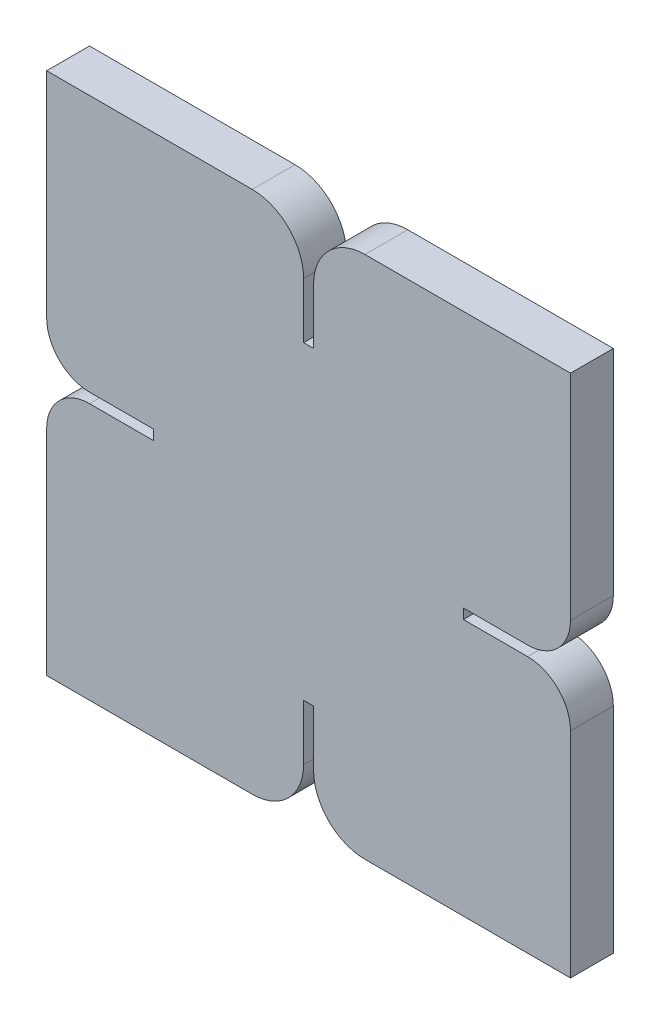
from build123d import *

# Parameters (mm, degrees)
BOSS_EXTRUDE1_DEPTH = 10


with BuildPart() as part:
    # Sketch1 → Boss-Extrude1 (new body)
    with BuildSketch(Plane.XY):
        with BuildLine():
            Line((1.166666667, 36.166666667), (1.166666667, 49.166666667))
            ThreePointArc((1.166666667, 49.166666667), (4.681385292, 57.651948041), (13.166666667, 61.166666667))
            Line((13.166666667, 61.166666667), (61.166666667, 61.166666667))
            Line((61.166666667, 61.166666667), (61.166666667, 11.166666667))
            ThreePointArc((61.166666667, 11.166666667), (58.237734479, 4.095598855), (51.166666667, 1.166666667))
            Line((51.166666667, 1.166666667), (36.166666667, 1.166666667))
            Line((36.166666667, 1.166666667), (36.166666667, -1.166666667))
            Line((36.166666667, -1.166666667), (51.166666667, -1.166666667))
            ThreePointArc((51.166666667, -1.166666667), (58.237734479, -4.095598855), (61.166666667, -11.166666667))
            Line((61.166666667, -11.166666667), (61.166666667, -61.166666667))
            Line((61.166666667, -61.166666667), (13.166666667, -61.166666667))
            ThreePointArc((13.166666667, -61.166666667), (4.681385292, -57.651948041), (1.166666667, -49.166666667))
            Line((1.166666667, -49.166666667), (1.166666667, -36.166666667))
            Line((1.166666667, -36.166666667), (-1.166666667, -36.166666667))
            Line((-1.166666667, -36.166666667), (-1.166666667, -49.166666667))
            ThreePointArc((-1.166666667, -49.166666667), (-4.681385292, -57.651948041), (-13.166666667, -61.166666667))
            Line((-13.166666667, -61.166666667), (-61.166666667, -61.166666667))
            Line((-61.166666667, -61.166666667), (-61.166666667, -11.166666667))
            ThreePointArc((-61.166666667, -11.166666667), (-58.237734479, -4.095598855), (-51.166666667, -1.166666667))
            Line((-51.166666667, -1.166666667), (-36.166666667, -1.166666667))
            Line((-36.166666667, -1.166666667), (-36.166666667, 1.166666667))
            Line((-36.166666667, 1.166666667), (-51.166666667, 1.166666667))
            ThreePointArc((-51.166666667, 1.166666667), (-58.237734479, 4.095598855), (-61.166666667, 11.166666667))
            Line((-61.166666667, 11.166666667), (-61.166666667, 61.166666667))
            Line((-61.166666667, 61.166666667), (-13.166666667, 61.166666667))
            ThreePointArc((-13.166666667, 61.166666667), (-4.681385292, 57.651948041), (-1.166666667, 49.166666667))
            Line((-1.166666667, 49.166666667), (-1.166666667, 36.166666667))
            Line((-1.166666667, 36.166666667), (1.166666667, 36.166666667))
        make_face()
    extrude(amount=BOSS_EXTRUDE1_DEPTH)


solid = part.part
